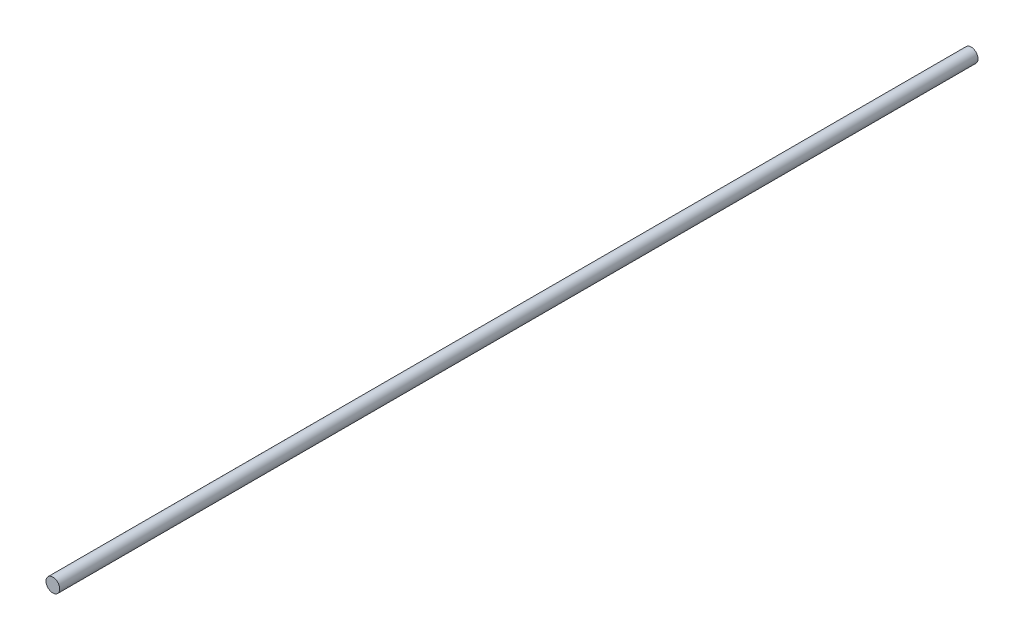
ISO-10303-21;
HEADER;
FILE_DESCRIPTION(('STEP AP214'),'2;1');
FILE_NAME('part.step','',(''),(''),'','','');
FILE_SCHEMA(('AUTOMOTIVE_DESIGN { 1 0 10303 214 1 1 1 1 }'));
ENDSEC;
DATA;
#1=APPLICATION_CONTEXT('core data for automotive mechanical design processes');
#2=APPLICATION_PROTOCOL_DEFINITION('international standard','automotive_design',2000,#1);
#3=PRODUCT_CONTEXT('',#1,'mechanical');
#4=PRODUCT('Part','Part','',(#3));
#5=PRODUCT_RELATED_PRODUCT_CATEGORY('part','',(#4));
#6=PRODUCT_DEFINITION_FORMATION('','',#4);
#7=PRODUCT_DEFINITION_CONTEXT('part definition',#1,'design');
#8=PRODUCT_DEFINITION('design','',#6,#7);
#9=PRODUCT_DEFINITION_SHAPE('','',#8);
#10=(LENGTH_UNIT() NAMED_UNIT(*) SI_UNIT(.MILLI.,.METRE.));
#11=(NAMED_UNIT(*) PLANE_ANGLE_UNIT() SI_UNIT($,.RADIAN.));
#12=(NAMED_UNIT(*) SI_UNIT($,.STERADIAN.) SOLID_ANGLE_UNIT());
#13=UNCERTAINTY_MEASURE_WITH_UNIT(LENGTH_MEASURE(1.E-05),#10,'distance_accuracy_value','');
#14=(GEOMETRIC_REPRESENTATION_CONTEXT(3) GLOBAL_UNCERTAINTY_ASSIGNED_CONTEXT((#13)) GLOBAL_UNIT_ASSIGNED_CONTEXT((#10,
#11,#12)) REPRESENTATION_CONTEXT('',''));
#15=CARTESIAN_POINT('',(0.,0.,0.));
#16=DIRECTION('',(0.,0.,1.));
#17=DIRECTION('',(1.,0.,0.));
#18=AXIS2_PLACEMENT_3D('',#15,#16,#17);
#19=CARTESIAN_POINT('',(0.,0.,101.6));
#20=DIRECTION('',(0.,0.,-1.));
#21=DIRECTION('',(-1.,0.,0.));
#22=AXIS2_PLACEMENT_3D('',#19,#20,#21);
#23=CYLINDRICAL_SURFACE('',#22,0.762);
#24=CARTESIAN_POINT('',(0.,0.,101.6));
#25=DIRECTION('',(0.,0.,1.));
#26=DIRECTION('',(1.,0.,0.));
#27=AXIS2_PLACEMENT_3D('',#24,#25,#26);
#28=CIRCLE('',#27,0.762);
#29=CARTESIAN_POINT('',(0.762,0.,101.6));
#30=VERTEX_POINT('',#29);
#31=EDGE_CURVE('E10',#30,#30,#28,.T.);
#32=ORIENTED_EDGE('',*,*,#31,.F.);
#33=EDGE_LOOP('',(#32));
#34=FACE_BOUND('',#33,.T.);
#35=CARTESIAN_POINT('',(0.,0.,0.));
#36=DIRECTION('',(0.,0.,1.));
#37=DIRECTION('',(1.,0.,0.));
#38=AXIS2_PLACEMENT_3D('',#35,#36,#37);
#39=CIRCLE('',#38,0.762);
#40=CARTESIAN_POINT('',(0.762,0.,0.));
#41=VERTEX_POINT('',#40);
#42=EDGE_CURVE('E34',#41,#41,#39,.T.);
#43=ORIENTED_EDGE('',*,*,#42,.T.);
#44=EDGE_LOOP('',(#43));
#45=FACE_BOUND('',#44,.T.);
#46=ADVANCED_FACE('F31',(#34,#45),#23,.T.);
#47=CARTESIAN_POINT('',(0.,0.,101.6));
#48=DIRECTION('',(0.,0.,1.));
#49=DIRECTION('',(1.,0.,0.));
#50=AXIS2_PLACEMENT_3D('',#47,#48,#49);
#51=PLANE('',#50);
#52=ORIENTED_EDGE('',*,*,#31,.T.);
#53=EDGE_LOOP('',(#52));
#54=FACE_BOUND('',#53,.T.);
#55=ADVANCED_FACE('F46',(#54),#51,.T.);
#56=CARTESIAN_POINT('',(0.,0.,0.));
#57=DIRECTION('',(0.,0.,1.));
#58=DIRECTION('',(1.,0.,0.));
#59=AXIS2_PLACEMENT_3D('',#56,#57,#58);
#60=PLANE('',#59);
#61=ORIENTED_EDGE('',*,*,#42,.F.);
#62=EDGE_LOOP('',(#61));
#63=FACE_BOUND('',#62,.T.);
#64=ADVANCED_FACE('F44',(#63),#60,.F.);
#65=CLOSED_SHELL('',(#46,#55,#64));
#66=MANIFOLD_SOLID_BREP('B2',#65);
#67=ADVANCED_BREP_SHAPE_REPRESENTATION('',(#18,#66),#14);
#68=SHAPE_DEFINITION_REPRESENTATION(#9,#67);
ENDSEC;
END-ISO-10303-21;
